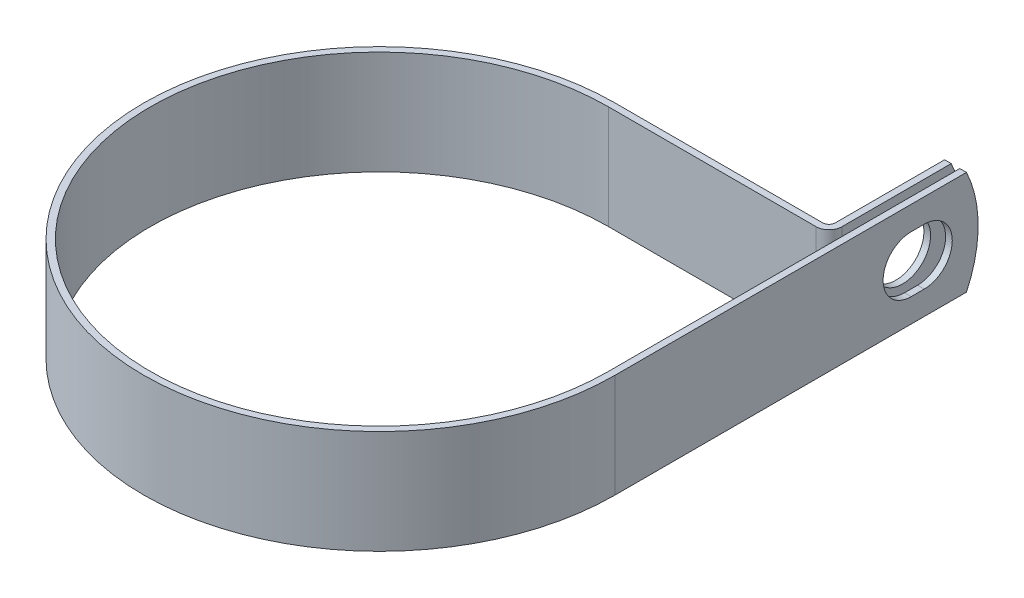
from build123d import *

# Parameters (mm, degrees)
EXTRUDE_THIN1_DEPTH = 9.525
SKETCH2_R           = 5.1562
CUT_EXTRUDE1_DEPTH  = 1.2192
CUT_EXTRUDE2_REACH  = 111.663
CUT_EXTRUDE3_DEPTH  = 107.524163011


with BuildPart() as part:
    # Sketch1 → Extrude-Thin1 (new, symmetric)
    with BuildSketch(Plane(origin=(0, 0, 0), x_dir=(1, 0, 0), z_dir=(0, 1, 0))):
        with BuildLine():
            Line((42.0624, 66.6496), (42.0624, 42.0624))
            Line((42.0624, 42.0624), (42.0624, 0))
            ThreePointArc((42.0624, 0), (-29.742608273, -29.742608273), (0, 42.0624))
            Line((0, 42.0624), (38.11016, 42.0624))
            ThreePointArc((38.11016, 42.0624), (39.791263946, 42.758736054), (40.4876, 44.43984))
            Line((40.4876, 44.43984), (40.4876, 66.6496))
            Line((40.4876, 66.6496), (39.2684, 66.6496))
            Line((39.2684, 66.6496), (39.2684, 44.43984))
            ThreePointArc((39.2684, 44.43984), (38.929159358, 43.620840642), (38.11016, 43.2816))
            Line((38.11016, 43.2816), (0, 43.2816))
            ThreePointArc((0, 43.2816), (-30.604712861, -30.604712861), (43.2816, 0))
            Line((43.2816, 0), (43.2816, 42.0624))
            Line((43.2816, 42.0624), (43.2816, 66.6496))
            Line((43.2816, 66.6496), (42.0624, 66.6496))
        make_face()
    extrude(amount=EXTRUDE_THIN1_DEPTH, both=True)

    # Sketch2 → Cut-Extrude1 (cut)
    with BuildSketch(Plane.ZY.offset(-39.2684)):
        with Locations((-55.5498, 0)):
            Circle(SKETCH2_R)
    extrude(amount=-CUT_EXTRUDE1_DEPTH, mode=Mode.SUBTRACT)

    # Sketch3 → Cut-Extrude2 (cut, up to next)
    with BuildSketch(Plane(origin=(43.2816, 0, 0), x_dir=(0, 0, -1), z_dir=(1, 0, 0)), mode=Mode.PRIVATE) as cut_extrude2_sk1:
        with BuildLine():
            Line((54.356, 5.1562), (56.7436, 5.1562))
            ThreePointArc((56.7436, 5.1562), (61.8998, 0), (56.7436, -5.1562))
            Line((56.7436, -5.1562), (54.356, -5.1562))
            ThreePointArc((54.356, -5.1562), (49.1998, 0), (54.356, 5.1562))
        make_face()
    cut_extrude2_tool1 = extrude(cut_extrude2_sk1.sketch, amount=-CUT_EXTRUDE2_REACH, mode=Mode.PRIVATE) & part.part
    add(cut_extrude2_tool1.solids().sort_by_distance((43.2816, 0, -55.5498))[0], mode=Mode.SUBTRACT)

    # Sketch4 → Cut-Extrude3 (cut, through all)
    with BuildSketch(Plane.ZY.offset(-39.2684)):
        with BuildLine():
            Line((-64.505063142, 9.525), (-66.6496, 9.525))
            Line((-66.6496, 9.525), (-66.6496, 0))
            ThreePointArc((-66.6496, 0), (-66.106838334, 4.881717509), (-64.505063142, 9.525))
        make_face()
        with BuildLine():
            ThreePointArc((-64.505063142, -9.525), (-66.106838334, -4.881717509), (-66.6496, 0))
            Line((-66.6496, 0), (-66.6496, -9.525))
            Line((-66.6496, -9.525), (-64.505063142, -9.525))
        make_face()
    extrude(amount=-CUT_EXTRUDE3_DEPTH, mode=Mode.SUBTRACT)


solid = part.part
